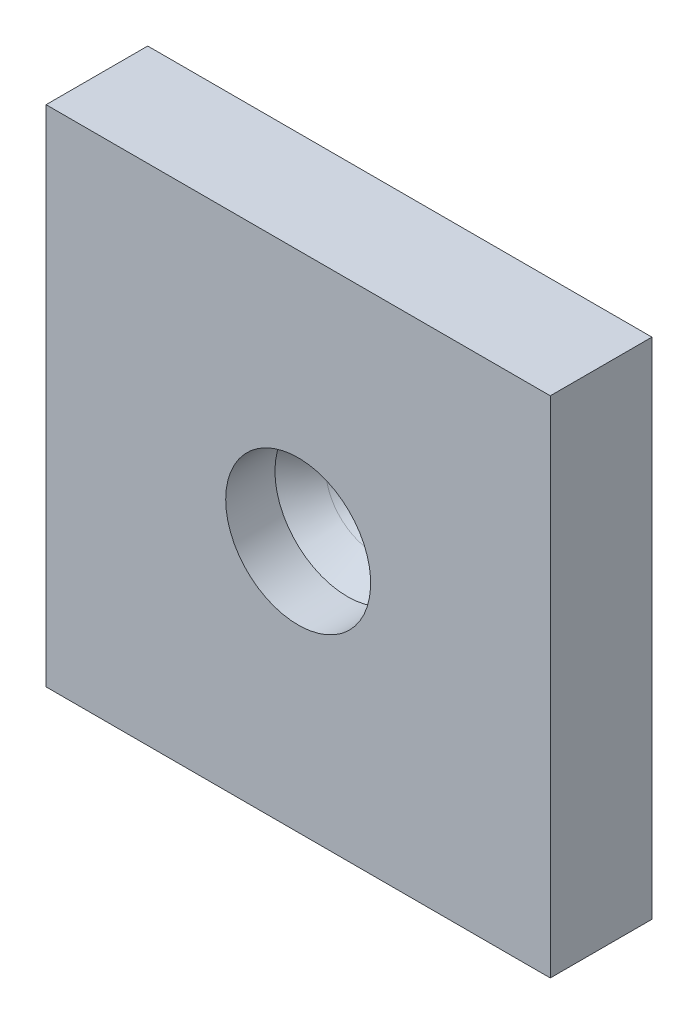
ISO-10303-21;
HEADER;
FILE_DESCRIPTION(('STEP AP214'),'2;1');
FILE_NAME('part.step','',(''),(''),'','','');
FILE_SCHEMA(('AUTOMOTIVE_DESIGN { 1 0 10303 214 1 1 1 1 }'));
ENDSEC;
DATA;
#1=APPLICATION_CONTEXT('core data for automotive mechanical design processes');
#2=APPLICATION_PROTOCOL_DEFINITION('international standard','automotive_design',2000,#1);
#3=PRODUCT_CONTEXT('',#1,'mechanical');
#4=PRODUCT('Part','Part','',(#3));
#5=PRODUCT_RELATED_PRODUCT_CATEGORY('part','',(#4));
#6=PRODUCT_DEFINITION_FORMATION('','',#4);
#7=PRODUCT_DEFINITION_CONTEXT('part definition',#1,'design');
#8=PRODUCT_DEFINITION('design','',#6,#7);
#9=PRODUCT_DEFINITION_SHAPE('','',#8);
#10=(LENGTH_UNIT() NAMED_UNIT(*) SI_UNIT(.MILLI.,.METRE.));
#11=(NAMED_UNIT(*) PLANE_ANGLE_UNIT() SI_UNIT($,.RADIAN.));
#12=(NAMED_UNIT(*) SI_UNIT($,.STERADIAN.) SOLID_ANGLE_UNIT());
#13=UNCERTAINTY_MEASURE_WITH_UNIT(LENGTH_MEASURE(1.E-05),#10,'distance_accuracy_value','');
#14=(GEOMETRIC_REPRESENTATION_CONTEXT(3) GLOBAL_UNCERTAINTY_ASSIGNED_CONTEXT((#13)) GLOBAL_UNIT_ASSIGNED_CONTEXT((#10,
#11,#12)) REPRESENTATION_CONTEXT('',''));
#15=CARTESIAN_POINT('',(0.,0.,0.));
#16=DIRECTION('',(0.,0.,1.));
#17=DIRECTION('',(1.,0.,0.));
#18=AXIS2_PLACEMENT_3D('',#15,#16,#17);
#19=CARTESIAN_POINT('',(-15.875,-15.875,1.5875));
#20=DIRECTION('',(-1.,0.,0.));
#21=DIRECTION('',(0.,-1.,0.));
#22=AXIS2_PLACEMENT_3D('',#19,#20,#21);
#23=PLANE('',#22);
#24=DIRECTION('',(0.,0.,1.));
#25=VECTOR('',#24,1.);
#26=CARTESIAN_POINT('',(-15.875,-15.875,1.5875));
#27=LINE('',#26,#25);
#28=CARTESIAN_POINT('',(-15.875,-15.875,0.));
#29=VERTEX_POINT('',#28);
#30=CARTESIAN_POINT('',(-15.875,-15.875,6.4));
#31=VERTEX_POINT('',#30);
#32=EDGE_CURVE('E39',#29,#31,#27,.T.);
#33=ORIENTED_EDGE('',*,*,#32,.T.);
#34=DIRECTION('',(0.,1.,0.));
#35=VECTOR('',#34,1.);
#36=CARTESIAN_POINT('',(-15.875,-15.875,6.4));
#37=LINE('',#36,#35);
#38=CARTESIAN_POINT('',(-15.875,15.875,6.4));
#39=VERTEX_POINT('',#38);
#40=EDGE_CURVE('E82',#31,#39,#37,.T.);
#41=ORIENTED_EDGE('',*,*,#40,.T.);
#42=DIRECTION('',(0.,0.,1.));
#43=VECTOR('',#42,1.);
#44=CARTESIAN_POINT('',(-15.875,15.875,1.5875));
#45=LINE('',#44,#43);
#46=CARTESIAN_POINT('',(-15.875,15.875,0.));
#47=VERTEX_POINT('',#46);
#48=EDGE_CURVE('E9',#47,#39,#45,.T.);
#49=ORIENTED_EDGE('',*,*,#48,.F.);
#50=DIRECTION('',(0.,-1.,0.));
#51=VECTOR('',#50,1.);
#52=CARTESIAN_POINT('',(-15.875,15.875,0.));
#53=LINE('',#52,#51);
#54=EDGE_CURVE('E132',#47,#29,#53,.T.);
#55=ORIENTED_EDGE('',*,*,#54,.T.);
#56=EDGE_LOOP('',(#33,#41,#49,#55));
#57=FACE_BOUND('',#56,.T.);
#58=ADVANCED_FACE('F14',(#57),#23,.T.);
#59=CARTESIAN_POINT('',(-15.875,15.875,1.5875));
#60=DIRECTION('',(0.,1.,0.));
#61=DIRECTION('',(-1.,0.,0.));
#62=AXIS2_PLACEMENT_3D('',#59,#60,#61);
#63=PLANE('',#62);
#64=ORIENTED_EDGE('',*,*,#48,.T.);
#65=DIRECTION('',(1.,0.,0.));
#66=VECTOR('',#65,1.);
#67=CARTESIAN_POINT('',(-15.875,15.875,6.4));
#68=LINE('',#67,#66);
#69=CARTESIAN_POINT('',(15.875,15.875,6.4));
#70=VERTEX_POINT('',#69);
#71=EDGE_CURVE('E71',#39,#70,#68,.T.);
#72=ORIENTED_EDGE('',*,*,#71,.T.);
#73=DIRECTION('',(0.,0.,1.));
#74=VECTOR('',#73,1.);
#75=CARTESIAN_POINT('',(15.875,15.875,1.5875));
#76=LINE('',#75,#74);
#77=CARTESIAN_POINT('',(15.875,15.875,0.));
#78=VERTEX_POINT('',#77);
#79=EDGE_CURVE('E55',#78,#70,#76,.T.);
#80=ORIENTED_EDGE('',*,*,#79,.F.);
#81=DIRECTION('',(-1.,0.,0.));
#82=VECTOR('',#81,1.);
#83=CARTESIAN_POINT('',(-15.875,15.875,0.));
#84=LINE('',#83,#82);
#85=EDGE_CURVE('E134',#78,#47,#84,.T.);
#86=ORIENTED_EDGE('',*,*,#85,.T.);
#87=EDGE_LOOP('',(#64,#72,#80,#86));
#88=FACE_BOUND('',#87,.T.);
#89=ADVANCED_FACE('F75',(#88),#63,.T.);
#90=CARTESIAN_POINT('',(0.,0.,6.34873000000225));
#91=DIRECTION('',(0.,0.,-1.));
#92=DIRECTION('',(0.,1.,0.));
#93=AXIS2_PLACEMENT_3D('',#90,#91,#92);
#94=CYLINDRICAL_SURFACE('',#93,4.56438);
#95=CARTESIAN_POINT('',(0.,0.,3.29975435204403));
#96=DIRECTION('',(0.,0.,1.));
#97=DIRECTION('',(0.,-1.,0.));
#98=AXIS2_PLACEMENT_3D('',#95,#96,#97);
#99=CIRCLE('',#98,4.56438);
#100=CARTESIAN_POINT('',(0.,-4.56438,3.29975435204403));
#101=VERTEX_POINT('',#100);
#102=EDGE_CURVE('E64',#101,#101,#99,.T.);
#103=ORIENTED_EDGE('',*,*,#102,.F.);
#104=EDGE_LOOP('',(#103));
#105=FACE_BOUND('',#104,.T.);
#106=CARTESIAN_POINT('',(0.,0.,6.4));
#107=DIRECTION('',(0.,0.,-1.));
#108=DIRECTION('',(-1.,0.,0.));
#109=AXIS2_PLACEMENT_3D('',#106,#107,#108);
#110=CIRCLE('',#109,4.56438);
#111=CARTESIAN_POINT('',(-4.56438,0.,6.4));
#112=VERTEX_POINT('',#111);
#113=EDGE_CURVE('E76',#112,#112,#110,.T.);
#114=ORIENTED_EDGE('',*,*,#113,.F.);
#115=EDGE_LOOP('',(#114));
#116=FACE_BOUND('',#115,.T.);
#117=ADVANCED_FACE('F110',(#105,#116),#94,.F.);
#118=CARTESIAN_POINT('',(0.,0.,3.29975435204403));
#119=DIRECTION('',(0.,0.,1.));
#120=DIRECTION('',(0.,-1.,0.));
#121=AXIS2_PLACEMENT_3D('',#118,#119,#120);
#122=CONICAL_SURFACE('',#121,4.56438,0.715584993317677);
#123=CARTESIAN_POINT('',(0.,0.,1.5875));
#124=DIRECTION('',(0.,0.,1.));
#125=DIRECTION('',(0.,1.,0.));
#126=AXIS2_PLACEMENT_3D('',#123,#124,#125);
#127=CIRCLE('',#126,3.07589561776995);
#128=CARTESIAN_POINT('',(0.,3.07589561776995,1.5875));
#129=VERTEX_POINT('',#128);
#130=EDGE_CURVE('E87',#129,#129,#127,.T.);
#131=ORIENTED_EDGE('',*,*,#130,.F.);
#132=EDGE_LOOP('',(#131));
#133=FACE_BOUND('',#132,.T.);
#134=ORIENTED_EDGE('',*,*,#102,.T.);
#135=EDGE_LOOP('',(#134));
#136=FACE_BOUND('',#135,.T.);
#137=ADVANCED_FACE('F99',(#133,#136),#122,.F.);
#138=CARTESIAN_POINT('',(0.,0.,1.5875));
#139=DIRECTION('',(0.,0.,1.));
#140=DIRECTION('',(0.,-1.,0.));
#141=AXIS2_PLACEMENT_3D('',#138,#139,#140);
#142=CONICAL_SURFACE('',#141,3.07589561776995,0.715584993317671);
#143=CARTESIAN_POINT('',(0.,0.,0.635));
#144=DIRECTION('',(0.,0.,-1.));
#145=DIRECTION('',(0.,1.,0.));
#146=AXIS2_PLACEMENT_3D('',#143,#144,#145);
#147=CIRCLE('',#146,2.2479);
#148=CARTESIAN_POINT('',(0.,2.2479,0.635));
#149=VERTEX_POINT('',#148);
#150=EDGE_CURVE('E128',#149,#149,#147,.T.);
#151=ORIENTED_EDGE('',*,*,#150,.T.);
#152=EDGE_LOOP('',(#151));
#153=FACE_BOUND('',#152,.T.);
#154=ORIENTED_EDGE('',*,*,#130,.T.);
#155=EDGE_LOOP('',(#154));
#156=FACE_BOUND('',#155,.T.);
#157=ADVANCED_FACE('F109',(#153,#156),#142,.F.);
#158=CARTESIAN_POINT('',(0.,0.,1.5875));
#159=DIRECTION('',(0.,0.,-1.));
#160=DIRECTION('',(0.,1.,0.));
#161=AXIS2_PLACEMENT_3D('',#158,#159,#160);
#162=CYLINDRICAL_SURFACE('',#161,2.2479);
#163=CARTESIAN_POINT('',(0.,0.,0.));
#164=DIRECTION('',(0.,0.,-1.));
#165=DIRECTION('',(0.,1.,0.));
#166=AXIS2_PLACEMENT_3D('',#163,#164,#165);
#167=CIRCLE('',#166,2.2479);
#168=CARTESIAN_POINT('',(0.,2.2479,0.));
#169=VERTEX_POINT('',#168);
#170=EDGE_CURVE('E83',#169,#169,#167,.T.);
#171=ORIENTED_EDGE('',*,*,#170,.T.);
#172=EDGE_LOOP('',(#171));
#173=FACE_BOUND('',#172,.T.);
#174=ORIENTED_EDGE('',*,*,#150,.F.);
#175=EDGE_LOOP('',(#174));
#176=FACE_BOUND('',#175,.T.);
#177=ADVANCED_FACE('F116',(#173,#176),#162,.F.);
#178=CARTESIAN_POINT('',(15.875,-15.875,1.5875));
#179=DIRECTION('',(0.,-1.,0.));
#180=DIRECTION('',(1.,0.,0.));
#181=AXIS2_PLACEMENT_3D('',#178,#179,#180);
#182=PLANE('',#181);
#183=DIRECTION('',(0.,0.,1.));
#184=VECTOR('',#183,1.);
#185=CARTESIAN_POINT('',(15.875,-15.875,1.5875));
#186=LINE('',#185,#184);
#187=CARTESIAN_POINT('',(15.875,-15.875,0.));
#188=VERTEX_POINT('',#187);
#189=CARTESIAN_POINT('',(15.875,-15.875,6.4));
#190=VERTEX_POINT('',#189);
#191=EDGE_CURVE('E24',#188,#190,#186,.T.);
#192=ORIENTED_EDGE('',*,*,#191,.T.);
#193=DIRECTION('',(-1.,0.,0.));
#194=VECTOR('',#193,1.);
#195=CARTESIAN_POINT('',(15.875,-15.875,6.4));
#196=LINE('',#195,#194);
#197=EDGE_CURVE('E73',#190,#31,#196,.T.);
#198=ORIENTED_EDGE('',*,*,#197,.T.);
#199=ORIENTED_EDGE('',*,*,#32,.F.);
#200=DIRECTION('',(1.,0.,0.));
#201=VECTOR('',#200,1.);
#202=CARTESIAN_POINT('',(-15.875,-15.875,0.));
#203=LINE('',#202,#201);
#204=EDGE_CURVE('E129',#29,#188,#203,.T.);
#205=ORIENTED_EDGE('',*,*,#204,.T.);
#206=EDGE_LOOP('',(#192,#198,#199,#205));
#207=FACE_BOUND('',#206,.T.);
#208=ADVANCED_FACE('F111',(#207),#182,.T.);
#209=CARTESIAN_POINT('',(0.,0.,0.));
#210=DIRECTION('',(0.,0.,1.));
#211=DIRECTION('',(0.,-1.,0.));
#212=AXIS2_PLACEMENT_3D('',#209,#210,#211);
#213=PLANE('',#212);
#214=DIRECTION('',(0.,1.,0.));
#215=VECTOR('',#214,1.);
#216=CARTESIAN_POINT('',(15.875,15.875,0.));
#217=LINE('',#216,#215);
#218=EDGE_CURVE('E59',#188,#78,#217,.T.);
#219=ORIENTED_EDGE('',*,*,#218,.F.);
#220=ORIENTED_EDGE('',*,*,#204,.F.);
#221=ORIENTED_EDGE('',*,*,#54,.F.);
#222=ORIENTED_EDGE('',*,*,#85,.F.);
#223=EDGE_LOOP('',(#219,#220,#221,#222));
#224=FACE_BOUND('',#223,.T.);
#225=ORIENTED_EDGE('',*,*,#170,.F.);
#226=EDGE_LOOP('',(#225));
#227=FACE_BOUND('',#226,.T.);
#228=ADVANCED_FACE('F16',(#224,#227),#213,.F.);
#229=CARTESIAN_POINT('',(15.875,15.875,1.5875));
#230=DIRECTION('',(1.,0.,0.));
#231=DIRECTION('',(0.,1.,0.));
#232=AXIS2_PLACEMENT_3D('',#229,#230,#231);
#233=PLANE('',#232);
#234=DIRECTION('',(0.,-1.,0.));
#235=VECTOR('',#234,1.);
#236=CARTESIAN_POINT('',(15.875,15.875,6.4));
#237=LINE('',#236,#235);
#238=EDGE_CURVE('E58',#70,#190,#237,.T.);
#239=ORIENTED_EDGE('',*,*,#238,.T.);
#240=ORIENTED_EDGE('',*,*,#191,.F.);
#241=ORIENTED_EDGE('',*,*,#218,.T.);
#242=ORIENTED_EDGE('',*,*,#79,.T.);
#243=EDGE_LOOP('',(#239,#240,#241,#242));
#244=FACE_BOUND('',#243,.T.);
#245=ADVANCED_FACE('F57',(#244),#233,.T.);
#246=CARTESIAN_POINT('',(0.,0.,6.4));
#247=DIRECTION('',(0.,0.,-1.));
#248=DIRECTION('',(-1.,0.,0.));
#249=AXIS2_PLACEMENT_3D('',#246,#247,#248);
#250=PLANE('',#249);
#251=ORIENTED_EDGE('',*,*,#113,.T.);
#252=EDGE_LOOP('',(#251));
#253=FACE_BOUND('',#252,.T.);
#254=ORIENTED_EDGE('',*,*,#71,.F.);
#255=ORIENTED_EDGE('',*,*,#40,.F.);
#256=ORIENTED_EDGE('',*,*,#197,.F.);
#257=ORIENTED_EDGE('',*,*,#238,.F.);
#258=EDGE_LOOP('',(#254,#255,#256,#257));
#259=FACE_BOUND('',#258,.T.);
#260=ADVANCED_FACE('F69',(#253,#259),#250,.F.);
#261=CLOSED_SHELL('',(#58,#89,#117,#137,#157,#177,#208,#228,#245,#260));
#262=MANIFOLD_SOLID_BREP('B1',#261);
#263=ADVANCED_BREP_SHAPE_REPRESENTATION('',(#18,#262),#14);
#264=SHAPE_DEFINITION_REPRESENTATION(#9,#263);
ENDSEC;
END-ISO-10303-21;
